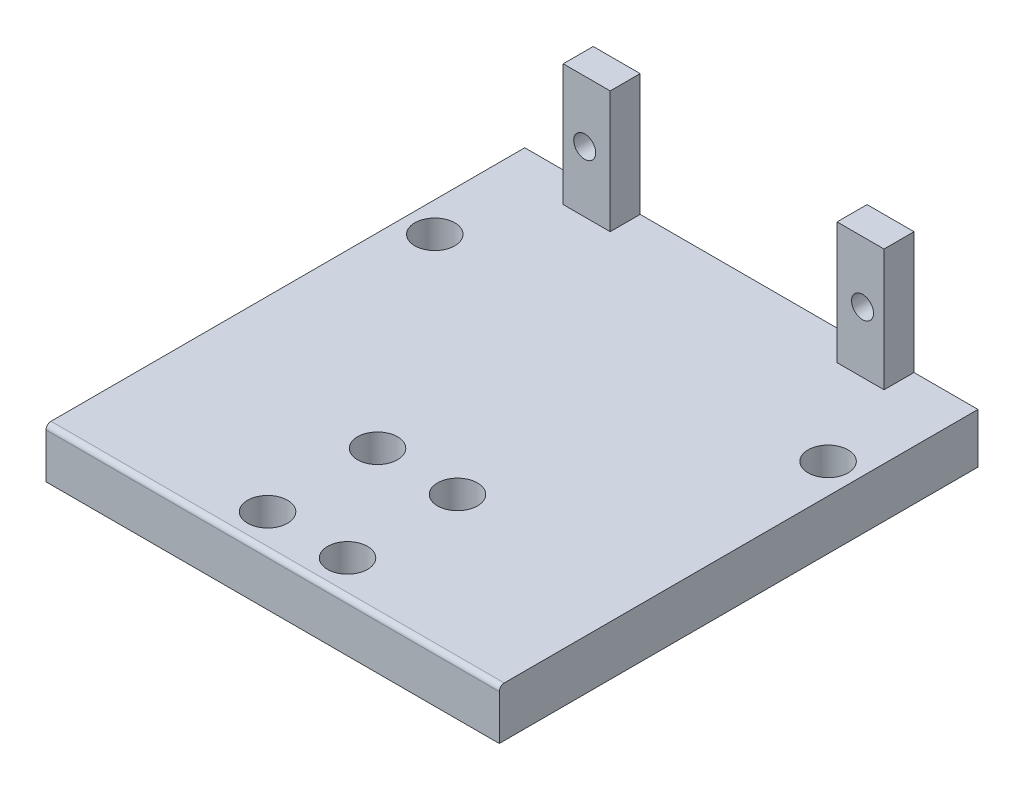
from build123d import *

# Parameters (mm, degrees)
BOSS_EXTRUDE1_DEPTH = 47.9
SKETCH4_W           = 91.495453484
SKETCH4_H           = 57.017695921
CUT_EXTRUDE3_DEPTH  = 20
BOSS_EXTRUDE2_DEPTH = 3
FILLET1_R           = 0.5
SKETCH7_W           = 5
SKETCH7_H           = 47.9
CUT_EXTRUDE4_DEPTH  = 31
SKETCH8_W           = 14.75
SKETCH8_H           = 46.9
SKETCH8_W_2         = 14.5
CUT_EXTRUDE6_DEPTH  = 90.636878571
SKETCH9_W           = 45.35
SKETCH9_H           = 26.396021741
CUT_EXTRUDE7_DEPTH  = 3
BOSS_EXTRUDE3_DEPTH = 3
SKETCH12_W          = 22.7
SKETCH12_H          = 12.2
CUT_EXTRUDE8_DEPTH  = 104.043728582
SKETCH13_W          = 45.35
SKETCH13_H          = 5
BOSS_EXTRUDE4_DEPTH = 3
SKETCH16_R          = 2
CUT_EXTRUDE9_DEPTH  = 10
SKETCH18_R          = 2
CUT_EXTRUDE10_DEPTH = 10


with BuildPart() as part:
    # Sketch1 → Boss-Extrude1 (new body)
    with BuildSketch(Plane.XY):
        Polygon((0, 0), (0, 56), (75.6, 56), (75.6, 0), (70.6, 0), (70.6, 51), (5, 51), (5, 0), align=None)
    extrude(amount=BOSS_EXTRUDE1_DEPTH)

    # Sketch4 → Cut-Extrude3 (cut)
    with BuildSketch(Plane.XZ):
        with Locations((38.801775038, 24.20044376)):
            Rectangle(SKETCH4_W, SKETCH4_H)
    extrude(amount=-CUT_EXTRUDE3_DEPTH, mode=Mode.SUBTRACT)

    # Sketch6 → Boss-Extrude2 (add)
    with BuildSketch(Plane(origin=(0, 56, 0), x_dir=(1, 0, 0), z_dir=(0, 1, 0))):
        Polygon((26.9, -4.3), (26.9, 0), (24.9, 0), (24.9, -2.3), (20.1, -2.3), (20.1, -8.8), (24.9, -8.8), (24.9, -24.5), (51.4, -24.5), (51.4, -8.8), (56.2, -8.8), (56.2, -2.3), (51.4, -2.3), (51.4, 0), (49.4, 0), (49.4, -4.3), (54.2, -4.3), (54.2, -6.8), (49.4, -6.8), (49.4, -22.5), (26.9, -22.5), (26.9, -6.8), (22.1, -6.8), (22.1, -4.3), align=None)
    extrude(amount=BOSS_EXTRUDE2_DEPTH)

    # Fillet1
    fillet1_edges = [part.edges().sort_by_distance(p)[0] for p in [
        (0, 56, 23.95),
        (75.6, 56, 23.95),
        (37.8, 56, 47.9),
        (12.45, 56, 0),
        (24.9, 57.5, 0),
        (51.4, 57.5, 0),
        (24.9, 56, 1.15),
        (51.4, 56, 1.15),
        (53.8, 56, 2.3),
        (56.2, 56, 5.55),
        (53.8, 56, 8.8),
        (51.4, 56, 16.65),
        (38.15, 56, 24.5),
        (24.9, 56, 16.65),
        (22.5, 56, 8.8),
        (20.1, 56, 5.55),
        (22.5, 56, 2.3),
        (63.5, 56, 0),
    ]]
    fillet(fillet1_edges, radius=FILLET1_R)

    # Sketch7 → Cut-Extrude4 (cut)
    with BuildSketch(Plane.XZ.offset(-20)):
        with Locations((2.5, 23.95)):
            Rectangle(SKETCH7_W, SKETCH7_H)
        with Locations((73.1, 23.95)):
            Rectangle(SKETCH7_W, SKETCH7_H)
    extrude(amount=-CUT_EXTRUDE4_DEPTH, mode=Mode.SUBTRACT)

    # Sketch8 → Cut-Extrude6 (cut, through all)
    with BuildSketch(Plane(origin=(0, 56, 0), x_dir=(1, 0, 0), z_dir=(0, 1, 0))):
        with Locations((7.875, -23.95)):
            Rectangle(SKETCH8_W, SKETCH8_H)
        Polygon((0.25, -47.65), (0.25, 0), (0, 0), (0, -47.9), (15.25, -47.9), (15.25, -47.65), align=None)
        Polygon((15.25, -0.5), (15.25, 0), (0.25, 0), (0.25, -47.65), (15.25, -47.65), (15.25, -47.4), (0.5, -47.4), (0.5, -0.5), align=None)
        with Locations((67.85, -23.95)):
            Rectangle(SKETCH8_W_2, SKETCH8_H)
        Polygon((75.1, -47.4), (60.6, -47.4), (60.6, -47.9), (75.6, -47.9), (75.6, 0), (60.6, 0), (60.6, -0.5), (75.1, -0.5), align=None)
    extrude(amount=-CUT_EXTRUDE6_DEPTH, mode=Mode.SUBTRACT)

    # Sketch9 → Cut-Extrude7 (cut)
    with BuildSketch(Plane(origin=(0, 59, 0), x_dir=(1, 0, 0), z_dir=(0, 1, 0))):
        with Locations((37.925, -13.198010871)):
            Rectangle(SKETCH9_W, SKETCH9_H)
    extrude(amount=-CUT_EXTRUDE7_DEPTH, mode=Mode.SUBTRACT)

    # Sketch11 → Boss-Extrude3 (add)
    with BuildSketch(Plane(origin=(0, 0, 0), x_dir=(-1, 0, 0), z_dir=(0, 0, -1))):
        with BuildLine():
            Line((-50.95, 62.1), (-38.15, 62.1))
            Line((-38.15, 62.1), (-38.15, 68.2))
            Line((-38.15, 68.2), (-54.2, 68.2))
            Line((-54.2, 68.2), (-54.2, 62.1))
            Line((-54.2, 62.1), (-53.15, 62.1))
            ThreePointArc((-53.15, 62.1), (-52.05, 63.2), (-50.95, 62.1))
        make_face()
        with BuildLine():
            Line((-51.033974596, 56), (-38.15, 56))
            Line((-38.15, 56), (-38.15, 62.1))
            Line((-38.15, 62.1), (-50.95, 62.1))
            ThreePointArc((-50.95, 62.1), (-52.05, 61), (-53.15, 62.1))
            Line((-53.15, 62.1), (-54.2, 62.1))
            Line((-54.2, 62.1), (-54.2, 56))
            Line((-54.2, 56), (-51.033974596, 56))
        make_face()
        with BuildLine():
            Line((-38.15, 68.2), (-38.15, 62.1))
            Line((-38.15, 62.1), (-25.35, 62.1))
            ThreePointArc((-25.35, 62.1), (-24.25, 63.2), (-23.15, 62.1))
            Line((-23.15, 62.1), (-22.1, 62.1))
            Line((-22.1, 62.1), (-22.1, 68.2))
            Line((-22.1, 68.2), (-38.15, 68.2))
        make_face()
        with BuildLine():
            Line((-38.15, 62.1), (-38.15, 56))
            Line((-38.15, 56), (-25.266025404, 56))
            Line((-25.266025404, 56), (-22.1, 56))
            Line((-22.1, 56), (-22.1, 62.1))
            Line((-22.1, 62.1), (-23.15, 62.1))
            ThreePointArc((-23.15, 62.1), (-24.25, 61), (-25.35, 62.1))
            Line((-25.35, 62.1), (-38.15, 62.1))
        make_face()
    extrude(amount=-BOSS_EXTRUDE3_DEPTH)

    # Sketch12 → Cut-Extrude8 (cut, through all)
    with BuildSketch(Plane(origin=(0, 0, 0), x_dir=(-1, 0, 0), z_dir=(0, 0, -1))):
        with Locations((-38.15, 62.1)):
            Rectangle(SKETCH12_W, SKETCH12_H)
    extrude(amount=-CUT_EXTRUDE8_DEPTH, mode=Mode.SUBTRACT)

    # Sketch13 → Boss-Extrude4 (add)
    with BuildSketch(Plane(origin=(0, 0, 0), x_dir=(-1, 0, 0), z_dir=(0, 0, -1))):
        with Locations((-37.925, 53.5)):
            Rectangle(SKETCH13_W, SKETCH13_H)
    extrude(amount=-BOSS_EXTRUDE4_DEPTH)

    # Sketch16 → Cut-Extrude9 (cut)
    with BuildSketch(Plane(origin=(0, 56, 0), x_dir=(1, 0, 0), z_dir=(0, 1, 0))):
        with Locations(Location((33.925, -33.404714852, 0), (0, 0, 270))):
            Circle(SKETCH16_R)
        with Locations(Location((41.925, -33.404714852, 0), (0, 0, 270))):
            Circle(SKETCH16_R)
        with Locations(Location((41.925, -44.404714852, 0), (0, 0, 270))):
            Circle(SKETCH16_R)
        with Locations(Location((33.925, -44.404714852, 0), (0, 0, 270))):
            Circle(SKETCH16_R)
    extrude(amount=-CUT_EXTRUDE9_DEPTH, mode=Mode.SUBTRACT)

    # Sketch18 → Cut-Extrude10 (cut)
    with BuildSketch(Plane(origin=(0, 56, 0), x_dir=(1, 0, 0), z_dir=(0, 1, 0))):
        with Locations(Location((18.25, -12, 0), (0, 0, 270))):
            Circle(SKETCH18_R)
        with Locations(Location((57.6, -12, 0), (0, 0, 270))):
            Circle(SKETCH18_R)
    extrude(amount=-CUT_EXTRUDE10_DEPTH, mode=Mode.SUBTRACT)


solid = part.part
